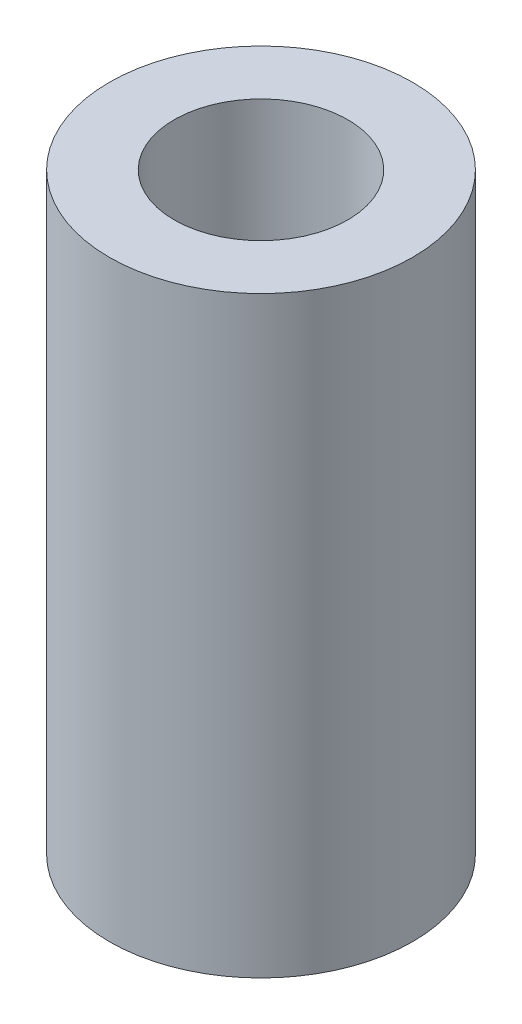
ISO-10303-21;
HEADER;
FILE_DESCRIPTION(('STEP AP214'),'2;1');
FILE_NAME('part.step','',(''),(''),'','','');
FILE_SCHEMA(('AUTOMOTIVE_DESIGN { 1 0 10303 214 1 1 1 1 }'));
ENDSEC;
DATA;
#1=APPLICATION_CONTEXT('core data for automotive mechanical design processes');
#2=APPLICATION_PROTOCOL_DEFINITION('international standard','automotive_design',2000,#1);
#3=PRODUCT_CONTEXT('',#1,'mechanical');
#4=PRODUCT('Part','Part','',(#3));
#5=PRODUCT_RELATED_PRODUCT_CATEGORY('part','',(#4));
#6=PRODUCT_DEFINITION_FORMATION('','',#4);
#7=PRODUCT_DEFINITION_CONTEXT('part definition',#1,'design');
#8=PRODUCT_DEFINITION('design','',#6,#7);
#9=PRODUCT_DEFINITION_SHAPE('','',#8);
#10=(LENGTH_UNIT() NAMED_UNIT(*) SI_UNIT(.MILLI.,.METRE.));
#11=(NAMED_UNIT(*) PLANE_ANGLE_UNIT() SI_UNIT($,.RADIAN.));
#12=(NAMED_UNIT(*) SI_UNIT($,.STERADIAN.) SOLID_ANGLE_UNIT());
#13=UNCERTAINTY_MEASURE_WITH_UNIT(LENGTH_MEASURE(1.E-05),#10,'distance_accuracy_value','');
#14=(GEOMETRIC_REPRESENTATION_CONTEXT(3) GLOBAL_UNCERTAINTY_ASSIGNED_CONTEXT((#13)) GLOBAL_UNIT_ASSIGNED_CONTEXT((#10,
#11,#12)) REPRESENTATION_CONTEXT('',''));
#15=CARTESIAN_POINT('',(0.,0.,0.));
#16=DIRECTION('',(0.,0.,1.));
#17=DIRECTION('',(1.,0.,0.));
#18=AXIS2_PLACEMENT_3D('',#15,#16,#17);
#19=CARTESIAN_POINT('',(0.,10.922,0.));
#20=DIRECTION('',(0.,-1.,0.));
#21=DIRECTION('',(0.,0.,-1.));
#22=AXIS2_PLACEMENT_3D('',#19,#20,#21);
#23=CYLINDRICAL_SURFACE('',#22,2.794);
#24=CARTESIAN_POINT('',(0.,10.922,0.));
#25=DIRECTION('',(0.,1.,0.));
#26=DIRECTION('',(0.,0.,1.));
#27=AXIS2_PLACEMENT_3D('',#24,#25,#26);
#28=CIRCLE('',#27,2.794);
#29=CARTESIAN_POINT('',(0.,10.922,2.794));
#30=VERTEX_POINT('',#29);
#31=EDGE_CURVE('E10',#30,#30,#28,.T.);
#32=ORIENTED_EDGE('',*,*,#31,.F.);
#33=EDGE_LOOP('',(#32));
#34=FACE_BOUND('',#33,.T.);
#35=CARTESIAN_POINT('',(0.,0.,0.));
#36=DIRECTION('',(0.,1.,0.));
#37=DIRECTION('',(0.,0.,1.));
#38=AXIS2_PLACEMENT_3D('',#35,#36,#37);
#39=CIRCLE('',#38,2.794);
#40=CARTESIAN_POINT('',(0.,0.,2.794));
#41=VERTEX_POINT('',#40);
#42=EDGE_CURVE('E32',#41,#41,#39,.T.);
#43=ORIENTED_EDGE('',*,*,#42,.T.);
#44=EDGE_LOOP('',(#43));
#45=FACE_BOUND('',#44,.T.);
#46=ADVANCED_FACE('F29',(#34,#45),#23,.T.);
#47=CARTESIAN_POINT('',(0.,10.922,0.));
#48=DIRECTION('',(0.,1.,0.));
#49=DIRECTION('',(0.,0.,1.));
#50=AXIS2_PLACEMENT_3D('',#47,#48,#49);
#51=PLANE('',#50);
#52=CARTESIAN_POINT('',(0.,10.922,0.));
#53=DIRECTION('',(0.,1.,0.));
#54=DIRECTION('',(0.,0.,1.));
#55=AXIS2_PLACEMENT_3D('',#52,#53,#54);
#56=CIRCLE('',#55,1.6);
#57=CARTESIAN_POINT('',(0.,10.922,1.6));
#58=VERTEX_POINT('',#57);
#59=EDGE_CURVE('E43',#58,#58,#56,.T.);
#60=ORIENTED_EDGE('',*,*,#59,.F.);
#61=EDGE_LOOP('',(#60));
#62=FACE_BOUND('',#61,.T.);
#63=ORIENTED_EDGE('',*,*,#31,.T.);
#64=EDGE_LOOP('',(#63));
#65=FACE_BOUND('',#64,.T.);
#66=ADVANCED_FACE('F49',(#62,#65),#51,.T.);
#67=CARTESIAN_POINT('',(0.,0.,0.));
#68=DIRECTION('',(0.,1.,0.));
#69=DIRECTION('',(0.,0.,1.));
#70=AXIS2_PLACEMENT_3D('',#67,#68,#69);
#71=PLANE('',#70);
#72=CARTESIAN_POINT('',(0.,0.,0.));
#73=DIRECTION('',(0.,1.,0.));
#74=DIRECTION('',(0.,0.,1.));
#75=AXIS2_PLACEMENT_3D('',#72,#73,#74);
#76=CIRCLE('',#75,1.6);
#77=CARTESIAN_POINT('',(0.,0.,1.6));
#78=VERTEX_POINT('',#77);
#79=EDGE_CURVE('E39',#78,#78,#76,.T.);
#80=ORIENTED_EDGE('',*,*,#79,.T.);
#81=EDGE_LOOP('',(#80));
#82=FACE_BOUND('',#81,.T.);
#83=ORIENTED_EDGE('',*,*,#42,.F.);
#84=EDGE_LOOP('',(#83));
#85=FACE_BOUND('',#84,.T.);
#86=ADVANCED_FACE('F51',(#82,#85),#71,.F.);
#87=CARTESIAN_POINT('',(0.,10.922,0.));
#88=DIRECTION('',(0.,1.,0.));
#89=DIRECTION('',(0.,0.,1.));
#90=AXIS2_PLACEMENT_3D('',#87,#88,#89);
#91=CYLINDRICAL_SURFACE('',#90,1.6);
#92=ORIENTED_EDGE('',*,*,#79,.F.);
#93=EDGE_LOOP('',(#92));
#94=FACE_BOUND('',#93,.T.);
#95=ORIENTED_EDGE('',*,*,#59,.T.);
#96=EDGE_LOOP('',(#95));
#97=FACE_BOUND('',#96,.T.);
#98=ADVANCED_FACE('F47',(#94,#97),#91,.F.);
#99=CLOSED_SHELL('',(#46,#66,#86,#98));
#100=MANIFOLD_SOLID_BREP('B2',#99);
#101=ADVANCED_BREP_SHAPE_REPRESENTATION('',(#18,#100),#14);
#102=SHAPE_DEFINITION_REPRESENTATION(#9,#101);
ENDSEC;
END-ISO-10303-21;
